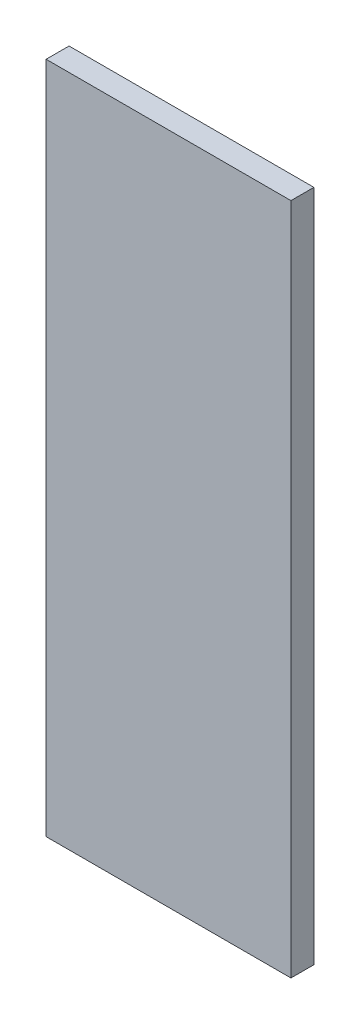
ISO-10303-21;
HEADER;
FILE_DESCRIPTION(('STEP AP214'),'2;1');
FILE_NAME('part.step','',(''),(''),'','','');
FILE_SCHEMA(('AUTOMOTIVE_DESIGN { 1 0 10303 214 1 1 1 1 }'));
ENDSEC;
DATA;
#1=APPLICATION_CONTEXT('core data for automotive mechanical design processes');
#2=APPLICATION_PROTOCOL_DEFINITION('international standard','automotive_design',2000,#1);
#3=PRODUCT_CONTEXT('',#1,'mechanical');
#4=PRODUCT('Part','Part','',(#3));
#5=PRODUCT_RELATED_PRODUCT_CATEGORY('part','',(#4));
#6=PRODUCT_DEFINITION_FORMATION('','',#4);
#7=PRODUCT_DEFINITION_CONTEXT('part definition',#1,'design');
#8=PRODUCT_DEFINITION('design','',#6,#7);
#9=PRODUCT_DEFINITION_SHAPE('','',#8);
#10=(LENGTH_UNIT() NAMED_UNIT(*) SI_UNIT(.MILLI.,.METRE.));
#11=(NAMED_UNIT(*) PLANE_ANGLE_UNIT() SI_UNIT($,.RADIAN.));
#12=(NAMED_UNIT(*) SI_UNIT($,.STERADIAN.) SOLID_ANGLE_UNIT());
#13=UNCERTAINTY_MEASURE_WITH_UNIT(LENGTH_MEASURE(1.E-05),#10,'distance_accuracy_value','');
#14=(GEOMETRIC_REPRESENTATION_CONTEXT(3) GLOBAL_UNCERTAINTY_ASSIGNED_CONTEXT((#13)) GLOBAL_UNIT_ASSIGNED_CONTEXT((#10,
#11,#12)) REPRESENTATION_CONTEXT('',''));
#15=CARTESIAN_POINT('',(0.,0.,0.));
#16=DIRECTION('',(0.,0.,1.));
#17=DIRECTION('',(1.,0.,0.));
#18=AXIS2_PLACEMENT_3D('',#15,#16,#17);
#19=CARTESIAN_POINT('',(0.,0.,0.));
#20=DIRECTION('',(0.,0.,1.));
#21=DIRECTION('',(1.,0.,0.));
#22=AXIS2_PLACEMENT_3D('',#19,#20,#21);
#23=PLANE('',#22);
#24=DIRECTION('',(1.,0.,0.));
#25=VECTOR('',#24,1.);
#26=CARTESIAN_POINT('',(8.,21.,0.));
#27=LINE('',#26,#25);
#28=CARTESIAN_POINT('',(-8.,21.,0.));
#29=VERTEX_POINT('',#28);
#30=CARTESIAN_POINT('',(8.,21.,0.));
#31=VERTEX_POINT('',#30);
#32=EDGE_CURVE('E81',#29,#31,#27,.T.);
#33=ORIENTED_EDGE('',*,*,#32,.T.);
#34=DIRECTION('',(0.,-1.,0.));
#35=VECTOR('',#34,1.);
#36=CARTESIAN_POINT('',(8.,-23.,0.));
#37=LINE('',#36,#35);
#38=CARTESIAN_POINT('',(8.,-23.,0.));
#39=VERTEX_POINT('',#38);
#40=EDGE_CURVE('E80',#31,#39,#37,.T.);
#41=ORIENTED_EDGE('',*,*,#40,.T.);
#42=DIRECTION('',(-1.,0.,0.));
#43=VECTOR('',#42,1.);
#44=CARTESIAN_POINT('',(-8.,-23.,0.));
#45=LINE('',#44,#43);
#46=CARTESIAN_POINT('',(-8.,-23.,0.));
#47=VERTEX_POINT('',#46);
#48=EDGE_CURVE('E25',#39,#47,#45,.T.);
#49=ORIENTED_EDGE('',*,*,#48,.T.);
#50=DIRECTION('',(0.,1.,0.));
#51=VECTOR('',#50,1.);
#52=CARTESIAN_POINT('',(-8.,21.,0.));
#53=LINE('',#52,#51);
#54=EDGE_CURVE('E10',#47,#29,#53,.T.);
#55=ORIENTED_EDGE('',*,*,#54,.T.);
#56=EDGE_LOOP('',(#33,#41,#49,#55));
#57=FACE_BOUND('',#56,.T.);
#58=ADVANCED_FACE('F16',(#57),#23,.F.);
#59=CARTESIAN_POINT('',(-8.,21.,2.));
#60=DIRECTION('',(1.,0.,0.));
#61=DIRECTION('',(0.,1.,0.));
#62=AXIS2_PLACEMENT_3D('',#59,#60,#61);
#63=PLANE('',#62);
#64=DIRECTION('',(0.,0.,1.));
#65=VECTOR('',#64,1.);
#66=CARTESIAN_POINT('',(-8.,-23.,2.));
#67=LINE('',#66,#65);
#68=CARTESIAN_POINT('',(-8.,-23.,1.5));
#69=VERTEX_POINT('',#68);
#70=EDGE_CURVE('E19',#47,#69,#67,.T.);
#71=ORIENTED_EDGE('',*,*,#70,.T.);
#72=DIRECTION('',(0.,-1.,0.));
#73=VECTOR('',#72,1.);
#74=CARTESIAN_POINT('',(-8.,0.,1.5));
#75=LINE('',#74,#73);
#76=CARTESIAN_POINT('',(-8.,21.,1.5));
#77=VERTEX_POINT('',#76);
#78=EDGE_CURVE('E88',#77,#69,#75,.T.);
#79=ORIENTED_EDGE('',*,*,#78,.F.);
#80=DIRECTION('',(0.,0.,-1.));
#81=VECTOR('',#80,1.);
#82=CARTESIAN_POINT('',(-8.,21.,2.));
#83=LINE('',#82,#81);
#84=EDGE_CURVE('E90',#77,#29,#83,.T.);
#85=ORIENTED_EDGE('',*,*,#84,.T.);
#86=ORIENTED_EDGE('',*,*,#54,.F.);
#87=EDGE_LOOP('',(#71,#79,#85,#86));
#88=FACE_BOUND('',#87,.T.);
#89=ADVANCED_FACE('F123',(#88),#63,.F.);
#90=CARTESIAN_POINT('',(-8.,-23.,2.));
#91=DIRECTION('',(0.,1.,0.));
#92=DIRECTION('',(1.,0.,0.));
#93=AXIS2_PLACEMENT_3D('',#90,#91,#92);
#94=PLANE('',#93);
#95=DIRECTION('',(0.,0.,1.));
#96=VECTOR('',#95,1.);
#97=CARTESIAN_POINT('',(8.,-23.,2.));
#98=LINE('',#97,#96);
#99=CARTESIAN_POINT('',(8.,-23.,1.5));
#100=VERTEX_POINT('',#99);
#101=EDGE_CURVE('E72',#39,#100,#98,.T.);
#102=ORIENTED_EDGE('',*,*,#101,.T.);
#103=DIRECTION('',(1.,0.,0.));
#104=VECTOR('',#103,1.);
#105=CARTESIAN_POINT('',(0.,-23.,1.5));
#106=LINE('',#105,#104);
#107=EDGE_CURVE('E75',#69,#100,#106,.T.);
#108=ORIENTED_EDGE('',*,*,#107,.F.);
#109=ORIENTED_EDGE('',*,*,#70,.F.);
#110=ORIENTED_EDGE('',*,*,#48,.F.);
#111=EDGE_LOOP('',(#102,#108,#109,#110));
#112=FACE_BOUND('',#111,.T.);
#113=ADVANCED_FACE('F74',(#112),#94,.F.);
#114=CARTESIAN_POINT('',(8.,-23.,2.));
#115=DIRECTION('',(-1.,0.,0.));
#116=DIRECTION('',(0.,1.,0.));
#117=AXIS2_PLACEMENT_3D('',#114,#115,#116);
#118=PLANE('',#117);
#119=DIRECTION('',(0.,0.,1.));
#120=VECTOR('',#119,1.);
#121=CARTESIAN_POINT('',(8.,21.,2.));
#122=LINE('',#121,#120);
#123=CARTESIAN_POINT('',(8.,21.,1.5));
#124=VERTEX_POINT('',#123);
#125=EDGE_CURVE('E94',#31,#124,#122,.T.);
#126=ORIENTED_EDGE('',*,*,#125,.T.);
#127=DIRECTION('',(0.,1.,0.));
#128=VECTOR('',#127,1.);
#129=CARTESIAN_POINT('',(8.,0.,1.5));
#130=LINE('',#129,#128);
#131=EDGE_CURVE('E86',#100,#124,#130,.T.);
#132=ORIENTED_EDGE('',*,*,#131,.F.);
#133=ORIENTED_EDGE('',*,*,#101,.F.);
#134=ORIENTED_EDGE('',*,*,#40,.F.);
#135=EDGE_LOOP('',(#126,#132,#133,#134));
#136=FACE_BOUND('',#135,.T.);
#137=ADVANCED_FACE('F92',(#136),#118,.F.);
#138=CARTESIAN_POINT('',(8.,21.,2.));
#139=DIRECTION('',(0.,-1.,0.));
#140=DIRECTION('',(0.,0.,-1.));
#141=AXIS2_PLACEMENT_3D('',#138,#139,#140);
#142=PLANE('',#141);
#143=ORIENTED_EDGE('',*,*,#84,.F.);
#144=DIRECTION('',(-1.,0.,0.));
#145=VECTOR('',#144,1.);
#146=CARTESIAN_POINT('',(0.,21.,1.5));
#147=LINE('',#146,#145);
#148=EDGE_CURVE('E97',#124,#77,#147,.T.);
#149=ORIENTED_EDGE('',*,*,#148,.F.);
#150=ORIENTED_EDGE('',*,*,#125,.F.);
#151=ORIENTED_EDGE('',*,*,#32,.F.);
#152=EDGE_LOOP('',(#143,#149,#150,#151));
#153=FACE_BOUND('',#152,.T.);
#154=ADVANCED_FACE('F125',(#153),#142,.F.);
#155=CARTESIAN_POINT('',(0.,0.,1.5));
#156=DIRECTION('',(0.,0.,1.));
#157=DIRECTION('',(1.,0.,0.));
#158=AXIS2_PLACEMENT_3D('',#155,#156,#157);
#159=PLANE('',#158);
#160=ORIENTED_EDGE('',*,*,#131,.T.);
#161=ORIENTED_EDGE('',*,*,#148,.T.);
#162=ORIENTED_EDGE('',*,*,#78,.T.);
#163=ORIENTED_EDGE('',*,*,#107,.T.);
#164=EDGE_LOOP('',(#160,#161,#162,#163));
#165=FACE_BOUND('',#164,.T.);
#166=ADVANCED_FACE('F84',(#165),#159,.T.);
#167=CLOSED_SHELL('',(#58,#89,#113,#137,#154,#166));
#168=MANIFOLD_SOLID_BREP('B1',#167);
#169=ADVANCED_BREP_SHAPE_REPRESENTATION('',(#18,#168),#14);
#170=SHAPE_DEFINITION_REPRESENTATION(#9,#169);
ENDSEC;
END-ISO-10303-21;
